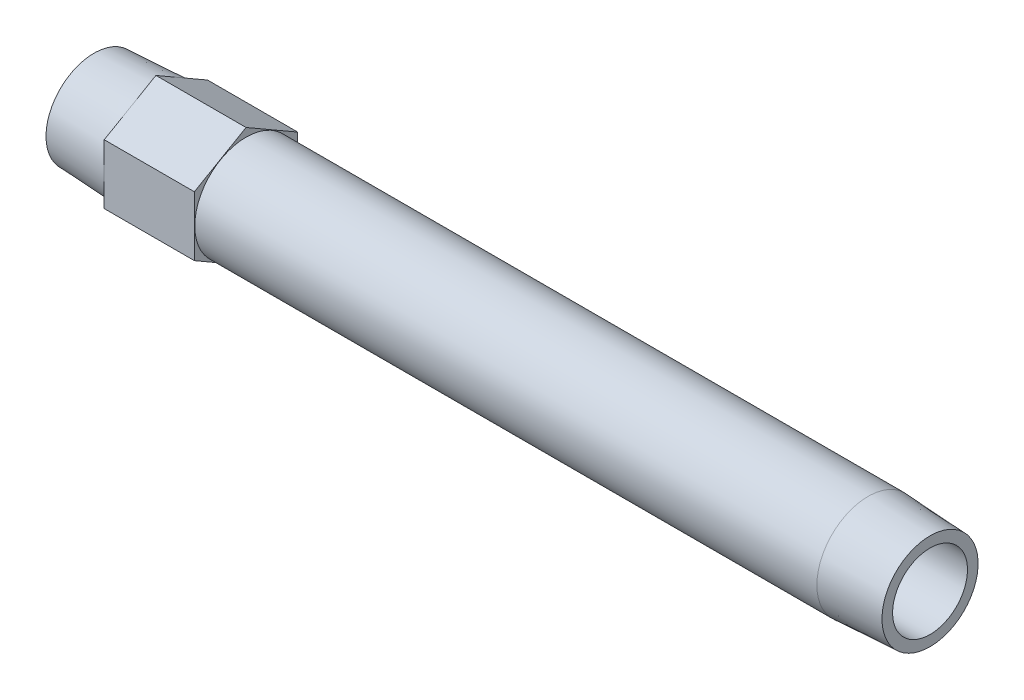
ISO-10303-21;
HEADER;
FILE_DESCRIPTION(('STEP AP214'),'2;1');
FILE_NAME('part.step','',(''),(''),'','','');
FILE_SCHEMA(('AUTOMOTIVE_DESIGN { 1 0 10303 214 1 1 1 1 }'));
ENDSEC;
DATA;
#1=APPLICATION_CONTEXT('core data for automotive mechanical design processes');
#2=APPLICATION_PROTOCOL_DEFINITION('international standard','automotive_design',2000,#1);
#3=PRODUCT_CONTEXT('',#1,'mechanical');
#4=PRODUCT('Part','Part','',(#3));
#5=PRODUCT_RELATED_PRODUCT_CATEGORY('part','',(#4));
#6=PRODUCT_DEFINITION_FORMATION('','',#4);
#7=PRODUCT_DEFINITION_CONTEXT('part definition',#1,'design');
#8=PRODUCT_DEFINITION('design','',#6,#7);
#9=PRODUCT_DEFINITION_SHAPE('','',#8);
#10=(LENGTH_UNIT() NAMED_UNIT(*) SI_UNIT(.MILLI.,.METRE.));
#11=(NAMED_UNIT(*) PLANE_ANGLE_UNIT() SI_UNIT($,.RADIAN.));
#12=(NAMED_UNIT(*) SI_UNIT($,.STERADIAN.) SOLID_ANGLE_UNIT());
#13=UNCERTAINTY_MEASURE_WITH_UNIT(LENGTH_MEASURE(1.E-05),#10,'distance_accuracy_value','');
#14=(GEOMETRIC_REPRESENTATION_CONTEXT(3) GLOBAL_UNCERTAINTY_ASSIGNED_CONTEXT((#13)) GLOBAL_UNIT_ASSIGNED_CONTEXT((#10,
#11,#12)) REPRESENTATION_CONTEXT('',''));
#15=CARTESIAN_POINT('',(0.,0.,0.));
#16=DIRECTION('',(0.,0.,1.));
#17=DIRECTION('',(1.,0.,0.));
#18=AXIS2_PLACEMENT_3D('',#15,#16,#17);
#19=CARTESIAN_POINT('',(0.,0.,-8.03071885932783));
#20=DIRECTION('',(1.,0.,0.));
#21=DIRECTION('',(0.,0.,-1.));
#22=AXIS2_PLACEMENT_3D('',#19,#20,#21);
#23=PLANE('',#22);
#24=CARTESIAN_POINT('',(0.,0.,0.));
#25=DIRECTION('',(-1.,0.,0.));
#26=DIRECTION('',(0.,0.,1.));
#27=AXIS2_PLACEMENT_3D('',#24,#25,#26);
#28=CIRCLE('',#27,8.03071885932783);
#29=CARTESIAN_POINT('',(0.,0.,8.03071885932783));
#30=VERTEX_POINT('',#29);
#31=EDGE_CURVE('E147',#30,#30,#28,.T.);
#32=ORIENTED_EDGE('',*,*,#31,.T.);
#33=EDGE_LOOP('',(#32));
#34=FACE_BOUND('',#33,.T.);
#35=CARTESIAN_POINT('',(0.,0.,0.));
#36=DIRECTION('',(1.,0.,0.));
#37=DIRECTION('',(0.,0.,1.));
#38=AXIS2_PLACEMENT_3D('',#35,#36,#37);
#39=CIRCLE('',#38,6.2611);
#40=CARTESIAN_POINT('',(0.,0.,6.2611));
#41=VERTEX_POINT('',#40);
#42=EDGE_CURVE('E159',#41,#41,#39,.T.);
#43=ORIENTED_EDGE('',*,*,#42,.T.);
#44=EDGE_LOOP('',(#43));
#45=FACE_BOUND('',#44,.T.);
#46=ADVANCED_FACE('F15',(#34,#45),#23,.F.);
#47=CARTESIAN_POINT('',(139.7,0.,-8.0307188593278));
#48=DIRECTION('',(-1.,0.,0.));
#49=DIRECTION('',(0.,0.,1.));
#50=AXIS2_PLACEMENT_3D('',#47,#48,#49);
#51=PLANE('',#50);
#52=CARTESIAN_POINT('',(139.7,0.,0.));
#53=DIRECTION('',(-1.,0.,0.));
#54=DIRECTION('',(0.,0.,1.));
#55=AXIS2_PLACEMENT_3D('',#52,#53,#54);
#56=CIRCLE('',#55,8.0307188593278);
#57=CARTESIAN_POINT('',(139.7,0.,8.0307188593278));
#58=VERTEX_POINT('',#57);
#59=EDGE_CURVE('E150',#58,#58,#56,.T.);
#60=ORIENTED_EDGE('',*,*,#59,.F.);
#61=EDGE_LOOP('',(#60));
#62=FACE_BOUND('',#61,.T.);
#63=CARTESIAN_POINT('',(139.7,0.,0.));
#64=DIRECTION('',(-1.,0.,0.));
#65=DIRECTION('',(0.,0.,1.));
#66=AXIS2_PLACEMENT_3D('',#63,#64,#65);
#67=CIRCLE('',#66,6.2611);
#68=CARTESIAN_POINT('',(139.7,0.,6.2611));
#69=VERTEX_POINT('',#68);
#70=EDGE_CURVE('E156',#69,#69,#67,.F.);
#71=ORIENTED_EDGE('',*,*,#70,.F.);
#72=EDGE_LOOP('',(#71));
#73=FACE_BOUND('',#72,.T.);
#74=ADVANCED_FACE('F178',(#62,#73),#51,.F.);
#75=CARTESIAN_POINT('',(25.4,-4.9859969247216,-8.636));
#76=DIRECTION('',(1.,0.,0.));
#77=DIRECTION('',(0.,1.,0.));
#78=AXIS2_PLACEMENT_3D('',#75,#76,#77);
#79=PLANE('',#78);
#80=DIRECTION('',(0.,0.5,-0.866025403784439));
#81=VECTOR('',#80,1.);
#82=CARTESIAN_POINT('',(25.4,-9.97199384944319,0.));
#83=LINE('',#82,#81);
#84=CARTESIAN_POINT('',(25.4,-9.97199384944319,0.));
#85=VERTEX_POINT('',#84);
#86=CARTESIAN_POINT('',(25.4,-4.9859969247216,-8.636));
#87=VERTEX_POINT('',#86);
#88=EDGE_CURVE('E103',#85,#87,#83,.T.);
#89=ORIENTED_EDGE('',*,*,#88,.T.);
#90=DIRECTION('',(0.,1.,0.));
#91=VECTOR('',#90,1.);
#92=CARTESIAN_POINT('',(25.4,-4.9859969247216,-8.636));
#93=LINE('',#92,#91);
#94=CARTESIAN_POINT('',(25.4,4.9859969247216,-8.636));
#95=VERTEX_POINT('',#94);
#96=EDGE_CURVE('E83',#87,#95,#93,.T.);
#97=ORIENTED_EDGE('',*,*,#96,.T.);
#98=DIRECTION('',(0.,0.5,0.866025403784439));
#99=VECTOR('',#98,1.);
#100=CARTESIAN_POINT('',(25.4,4.9859969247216,-8.636));
#101=LINE('',#100,#99);
#102=CARTESIAN_POINT('',(25.4,9.97199384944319,0.));
#103=VERTEX_POINT('',#102);
#104=EDGE_CURVE('E102',#95,#103,#101,.T.);
#105=ORIENTED_EDGE('',*,*,#104,.T.);
#106=DIRECTION('',(0.,-0.5,0.866025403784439));
#107=VECTOR('',#106,1.);
#108=CARTESIAN_POINT('',(25.4,9.97199384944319,0.));
#109=LINE('',#108,#107);
#110=CARTESIAN_POINT('',(25.4,4.9859969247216,8.636));
#111=VERTEX_POINT('',#110);
#112=EDGE_CURVE('E105',#103,#111,#109,.T.);
#113=ORIENTED_EDGE('',*,*,#112,.T.);
#114=DIRECTION('',(0.,-1.,0.));
#115=VECTOR('',#114,1.);
#116=CARTESIAN_POINT('',(25.4,4.9859969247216,8.636));
#117=LINE('',#116,#115);
#118=CARTESIAN_POINT('',(25.4,-4.9859969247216,8.636));
#119=VERTEX_POINT('',#118);
#120=EDGE_CURVE('E35',#111,#119,#117,.T.);
#121=ORIENTED_EDGE('',*,*,#120,.T.);
#122=DIRECTION('',(0.,-0.5,-0.866025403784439));
#123=VECTOR('',#122,1.);
#124=CARTESIAN_POINT('',(25.4,-4.9859969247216,8.636));
#125=LINE('',#124,#123);
#126=EDGE_CURVE('E30',#119,#85,#125,.T.);
#127=ORIENTED_EDGE('',*,*,#126,.T.);
#128=EDGE_LOOP('',(#89,#97,#105,#113,#121,#127));
#129=FACE_BOUND('',#128,.T.);
#130=CARTESIAN_POINT('',(25.4,0.,0.));
#131=DIRECTION('',(1.,0.,0.));
#132=DIRECTION('',(0.,1.,0.));
#133=AXIS2_PLACEMENT_3D('',#130,#131,#132);
#134=CIRCLE('',#133,8.5725);
#135=CARTESIAN_POINT('',(25.4,8.5725,0.));
#136=VERTEX_POINT('',#135);
#137=EDGE_CURVE('E89',#136,#136,#134,.F.);
#138=ORIENTED_EDGE('',*,*,#137,.T.);
#139=EDGE_LOOP('',(#138));
#140=FACE_BOUND('',#139,.T.);
#141=ADVANCED_FACE('F124',(#129,#140),#79,.T.);
#142=CARTESIAN_POINT('',(10.3378,-4.9859969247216,-8.636));
#143=DIRECTION('',(1.,0.,0.));
#144=DIRECTION('',(0.,1.,0.));
#145=AXIS2_PLACEMENT_3D('',#142,#143,#144);
#146=PLANE('',#145);
#147=DIRECTION('',(0.,0.5,-0.866025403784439));
#148=VECTOR('',#147,1.);
#149=CARTESIAN_POINT('',(10.3378,-9.97199384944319,0.));
#150=LINE('',#149,#148);
#151=CARTESIAN_POINT('',(10.3378,-9.97199384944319,0.));
#152=VERTEX_POINT('',#151);
#153=CARTESIAN_POINT('',(10.3378,-4.9859969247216,-8.636));
#154=VERTEX_POINT('',#153);
#155=EDGE_CURVE('E73',#152,#154,#150,.T.);
#156=ORIENTED_EDGE('',*,*,#155,.F.);
#157=DIRECTION('',(0.,-0.5,-0.866025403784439));
#158=VECTOR('',#157,1.);
#159=CARTESIAN_POINT('',(10.3378,-4.9859969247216,8.636));
#160=LINE('',#159,#158);
#161=CARTESIAN_POINT('',(10.3378,-4.9859969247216,8.636));
#162=VERTEX_POINT('',#161);
#163=EDGE_CURVE('E99',#162,#152,#160,.T.);
#164=ORIENTED_EDGE('',*,*,#163,.F.);
#165=DIRECTION('',(0.,-1.,0.));
#166=VECTOR('',#165,1.);
#167=CARTESIAN_POINT('',(10.3378,4.9859969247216,8.636));
#168=LINE('',#167,#166);
#169=CARTESIAN_POINT('',(10.3378,4.9859969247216,8.636));
#170=VERTEX_POINT('',#169);
#171=EDGE_CURVE('E133',#170,#162,#168,.T.);
#172=ORIENTED_EDGE('',*,*,#171,.F.);
#173=DIRECTION('',(0.,-0.5,0.866025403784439));
#174=VECTOR('',#173,1.);
#175=CARTESIAN_POINT('',(10.3378,9.97199384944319,0.));
#176=LINE('',#175,#174);
#177=CARTESIAN_POINT('',(10.3378,9.97199384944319,0.));
#178=VERTEX_POINT('',#177);
#179=EDGE_CURVE('E129',#178,#170,#176,.T.);
#180=ORIENTED_EDGE('',*,*,#179,.F.);
#181=DIRECTION('',(0.,0.5,0.866025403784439));
#182=VECTOR('',#181,1.);
#183=CARTESIAN_POINT('',(10.3378,4.9859969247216,-8.636));
#184=LINE('',#183,#182);
#185=CARTESIAN_POINT('',(10.3378,4.9859969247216,-8.636));
#186=VERTEX_POINT('',#185);
#187=EDGE_CURVE('E75',#186,#178,#184,.T.);
#188=ORIENTED_EDGE('',*,*,#187,.F.);
#189=DIRECTION('',(0.,1.,0.));
#190=VECTOR('',#189,1.);
#191=CARTESIAN_POINT('',(10.3378,-4.9859969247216,-8.636));
#192=LINE('',#191,#190);
#193=EDGE_CURVE('E68',#154,#186,#192,.T.);
#194=ORIENTED_EDGE('',*,*,#193,.F.);
#195=EDGE_LOOP('',(#156,#164,#172,#180,#188,#194));
#196=FACE_BOUND('',#195,.T.);
#197=CARTESIAN_POINT('',(10.3378,0.,0.));
#198=DIRECTION('',(-1.,0.,0.));
#199=DIRECTION('',(0.,0.,1.));
#200=AXIS2_PLACEMENT_3D('',#197,#198,#199);
#201=CIRCLE('',#200,8.5725);
#202=CARTESIAN_POINT('',(10.3378,0.,8.5725));
#203=VERTEX_POINT('',#202);
#204=EDGE_CURVE('E95',#203,#203,#201,.T.);
#205=ORIENTED_EDGE('',*,*,#204,.F.);
#206=EDGE_LOOP('',(#205));
#207=FACE_BOUND('',#206,.T.);
#208=ADVANCED_FACE('F69',(#196,#207),#146,.F.);
#209=CARTESIAN_POINT('',(25.4,-9.97199384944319,0.));
#210=DIRECTION('',(0.,0.866025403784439,0.5));
#211=DIRECTION('',(0.,-0.5,0.866025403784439));
#212=AXIS2_PLACEMENT_3D('',#209,#210,#211);
#213=PLANE('',#212);
#214=ORIENTED_EDGE('',*,*,#155,.T.);
#215=DIRECTION('',(-1.,0.,0.));
#216=VECTOR('',#215,1.);
#217=CARTESIAN_POINT('',(25.4,-4.9859969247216,-8.636));
#218=LINE('',#217,#216);
#219=EDGE_CURVE('E10',#87,#154,#218,.T.);
#220=ORIENTED_EDGE('',*,*,#219,.F.);
#221=ORIENTED_EDGE('',*,*,#88,.F.);
#222=DIRECTION('',(-1.,0.,0.));
#223=VECTOR('',#222,1.);
#224=CARTESIAN_POINT('',(25.4,-9.97199384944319,0.));
#225=LINE('',#224,#223);
#226=EDGE_CURVE('E87',#85,#152,#225,.T.);
#227=ORIENTED_EDGE('',*,*,#226,.T.);
#228=EDGE_LOOP('',(#214,#220,#221,#227));
#229=FACE_BOUND('',#228,.T.);
#230=ADVANCED_FACE('F17',(#229),#213,.F.);
#231=CARTESIAN_POINT('',(25.4,-4.9859969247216,-8.636));
#232=DIRECTION('',(0.,0.,1.));
#233=DIRECTION('',(1.,0.,0.));
#234=AXIS2_PLACEMENT_3D('',#231,#232,#233);
#235=PLANE('',#234);
#236=ORIENTED_EDGE('',*,*,#193,.T.);
#237=DIRECTION('',(-1.,0.,0.));
#238=VECTOR('',#237,1.);
#239=CARTESIAN_POINT('',(25.4,4.9859969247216,-8.636));
#240=LINE('',#239,#238);
#241=EDGE_CURVE('E23',#95,#186,#240,.T.);
#242=ORIENTED_EDGE('',*,*,#241,.F.);
#243=ORIENTED_EDGE('',*,*,#96,.F.);
#244=ORIENTED_EDGE('',*,*,#219,.T.);
#245=EDGE_LOOP('',(#236,#242,#243,#244));
#246=FACE_BOUND('',#245,.T.);
#247=ADVANCED_FACE('F82',(#246),#235,.F.);
#248=CARTESIAN_POINT('',(25.4,4.9859969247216,-8.636));
#249=DIRECTION('',(0.,-0.866025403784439,0.5));
#250=DIRECTION('',(0.,-0.5,-0.866025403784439));
#251=AXIS2_PLACEMENT_3D('',#248,#249,#250);
#252=PLANE('',#251);
#253=ORIENTED_EDGE('',*,*,#187,.T.);
#254=DIRECTION('',(-1.,0.,0.));
#255=VECTOR('',#254,1.);
#256=CARTESIAN_POINT('',(25.4,9.97199384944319,0.));
#257=LINE('',#256,#255);
#258=EDGE_CURVE('E117',#103,#178,#257,.T.);
#259=ORIENTED_EDGE('',*,*,#258,.F.);
#260=ORIENTED_EDGE('',*,*,#104,.F.);
#261=ORIENTED_EDGE('',*,*,#241,.T.);
#262=EDGE_LOOP('',(#253,#259,#260,#261));
#263=FACE_BOUND('',#262,.T.);
#264=ADVANCED_FACE('F121',(#263),#252,.F.);
#265=CARTESIAN_POINT('',(25.4,9.97199384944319,0.));
#266=DIRECTION('',(0.,-0.866025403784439,-0.5));
#267=DIRECTION('',(0.,0.5,-0.866025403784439));
#268=AXIS2_PLACEMENT_3D('',#265,#266,#267);
#269=PLANE('',#268);
#270=ORIENTED_EDGE('',*,*,#179,.T.);
#271=DIRECTION('',(-1.,0.,0.));
#272=VECTOR('',#271,1.);
#273=CARTESIAN_POINT('',(25.4,4.9859969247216,8.636));
#274=LINE('',#273,#272);
#275=EDGE_CURVE('E114',#111,#170,#274,.T.);
#276=ORIENTED_EDGE('',*,*,#275,.F.);
#277=ORIENTED_EDGE('',*,*,#112,.F.);
#278=ORIENTED_EDGE('',*,*,#258,.T.);
#279=EDGE_LOOP('',(#270,#276,#277,#278));
#280=FACE_BOUND('',#279,.T.);
#281=ADVANCED_FACE('F128',(#280),#269,.F.);
#282=CARTESIAN_POINT('',(25.4,4.9859969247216,8.636));
#283=DIRECTION('',(0.,0.,-1.));
#284=DIRECTION('',(-1.,0.,0.));
#285=AXIS2_PLACEMENT_3D('',#282,#283,#284);
#286=PLANE('',#285);
#287=ORIENTED_EDGE('',*,*,#171,.T.);
#288=DIRECTION('',(-1.,0.,0.));
#289=VECTOR('',#288,1.);
#290=CARTESIAN_POINT('',(25.4,-4.9859969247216,8.636));
#291=LINE('',#290,#289);
#292=EDGE_CURVE('E111',#119,#162,#291,.T.);
#293=ORIENTED_EDGE('',*,*,#292,.F.);
#294=ORIENTED_EDGE('',*,*,#120,.F.);
#295=ORIENTED_EDGE('',*,*,#275,.T.);
#296=EDGE_LOOP('',(#287,#293,#294,#295));
#297=FACE_BOUND('',#296,.T.);
#298=ADVANCED_FACE('F132',(#297),#286,.F.);
#299=CARTESIAN_POINT('',(25.4,-4.9859969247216,8.636));
#300=DIRECTION('',(0.,0.866025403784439,-0.5));
#301=DIRECTION('',(0.,0.5,0.866025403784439));
#302=AXIS2_PLACEMENT_3D('',#299,#300,#301);
#303=PLANE('',#302);
#304=ORIENTED_EDGE('',*,*,#163,.T.);
#305=ORIENTED_EDGE('',*,*,#226,.F.);
#306=ORIENTED_EDGE('',*,*,#126,.F.);
#307=ORIENTED_EDGE('',*,*,#292,.T.);
#308=EDGE_LOOP('',(#304,#305,#306,#307));
#309=FACE_BOUND('',#308,.T.);
#310=ADVANCED_FACE('F135',(#309),#303,.F.);
#311=CARTESIAN_POINT('',(10.3378,0.,0.));
#312=DIRECTION('',(1.,0.,0.));
#313=DIRECTION('',(0.,0.,-1.));
#314=AXIS2_PLACEMENT_3D('',#311,#312,#313);
#315=CONICAL_SURFACE('',#314,8.5725,0.0523598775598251);
#316=ORIENTED_EDGE('',*,*,#31,.F.);
#317=EDGE_LOOP('',(#316));
#318=FACE_BOUND('',#317,.T.);
#319=ORIENTED_EDGE('',*,*,#204,.T.);
#320=EDGE_LOOP('',(#319));
#321=FACE_BOUND('',#320,.T.);
#322=ADVANCED_FACE('F187',(#318,#321),#315,.T.);
#323=CARTESIAN_POINT('',(-60.,0.,0.));
#324=DIRECTION('',(-1.,0.,0.));
#325=DIRECTION('',(0.,0.,1.));
#326=AXIS2_PLACEMENT_3D('',#323,#324,#325);
#327=CYLINDRICAL_SURFACE('',#326,8.5725);
#328=ORIENTED_EDGE('',*,*,#137,.F.);
#329=EDGE_LOOP('',(#328));
#330=FACE_BOUND('',#329,.T.);
#331=CARTESIAN_POINT('',(129.3622,0.,0.));
#332=DIRECTION('',(-1.,0.,0.));
#333=DIRECTION('',(0.,0.,1.));
#334=AXIS2_PLACEMENT_3D('',#331,#332,#333);
#335=CIRCLE('',#334,8.5725);
#336=CARTESIAN_POINT('',(129.3622,0.,8.5725));
#337=VERTEX_POINT('',#336);
#338=EDGE_CURVE('E153',#337,#337,#335,.T.);
#339=ORIENTED_EDGE('',*,*,#338,.T.);
#340=EDGE_LOOP('',(#339));
#341=FACE_BOUND('',#340,.T.);
#342=ADVANCED_FACE('F174',(#330,#341),#327,.T.);
#343=CARTESIAN_POINT('',(139.7,0.,0.));
#344=DIRECTION('',(-1.,0.,0.));
#345=DIRECTION('',(0.,0.,1.));
#346=AXIS2_PLACEMENT_3D('',#343,#344,#345);
#347=CONICAL_SURFACE('',#346,8.0307188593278,0.0523598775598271);
#348=ORIENTED_EDGE('',*,*,#338,.F.);
#349=EDGE_LOOP('',(#348));
#350=FACE_BOUND('',#349,.T.);
#351=ORIENTED_EDGE('',*,*,#59,.T.);
#352=EDGE_LOOP('',(#351));
#353=FACE_BOUND('',#352,.T.);
#354=ADVANCED_FACE('F167',(#350,#353),#347,.T.);
#355=CARTESIAN_POINT('',(142.16952778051,0.,0.));
#356=DIRECTION('',(-1.,0.,0.));
#357=DIRECTION('',(0.,0.,1.));
#358=AXIS2_PLACEMENT_3D('',#355,#356,#357);
#359=CYLINDRICAL_SURFACE('',#358,6.2611);
#360=ORIENTED_EDGE('',*,*,#70,.T.);
#361=EDGE_LOOP('',(#360));
#362=FACE_BOUND('',#361,.T.);
#363=ORIENTED_EDGE('',*,*,#42,.F.);
#364=EDGE_LOOP('',(#363));
#365=FACE_BOUND('',#364,.T.);
#366=ADVANCED_FACE('F165',(#362,#365),#359,.F.);
#367=CLOSED_SHELL('',(#46,#74,#141,#208,#230,#247,#264,#281,#298,#310,#322,#342,#354,#366));
#368=MANIFOLD_SOLID_BREP('B1',#367);
#369=ADVANCED_BREP_SHAPE_REPRESENTATION('',(#18,#368),#14);
#370=SHAPE_DEFINITION_REPRESENTATION(#9,#369);
ENDSEC;
END-ISO-10303-21;
